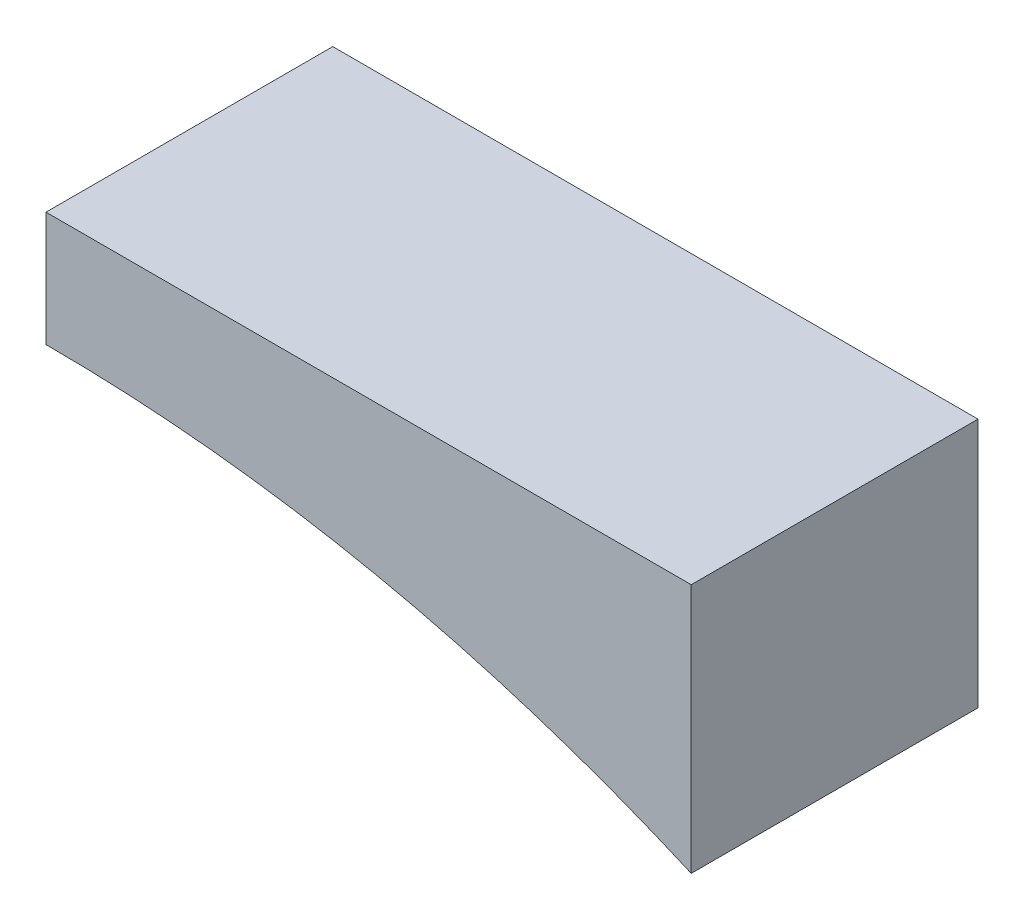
ISO-10303-21;
HEADER;
FILE_DESCRIPTION(('STEP AP214'),'2;1');
FILE_NAME('part.step','',(''),(''),'','','');
FILE_SCHEMA(('AUTOMOTIVE_DESIGN { 1 0 10303 214 1 1 1 1 }'));
ENDSEC;
DATA;
#1=APPLICATION_CONTEXT('core data for automotive mechanical design processes');
#2=APPLICATION_PROTOCOL_DEFINITION('international standard','automotive_design',2000,#1);
#3=PRODUCT_CONTEXT('',#1,'mechanical');
#4=PRODUCT('Part','Part','',(#3));
#5=PRODUCT_RELATED_PRODUCT_CATEGORY('part','',(#4));
#6=PRODUCT_DEFINITION_FORMATION('','',#4);
#7=PRODUCT_DEFINITION_CONTEXT('part definition',#1,'design');
#8=PRODUCT_DEFINITION('design','',#6,#7);
#9=PRODUCT_DEFINITION_SHAPE('','',#8);
#10=(LENGTH_UNIT() NAMED_UNIT(*) SI_UNIT(.MILLI.,.METRE.));
#11=(NAMED_UNIT(*) PLANE_ANGLE_UNIT() SI_UNIT($,.RADIAN.));
#12=(NAMED_UNIT(*) SI_UNIT($,.STERADIAN.) SOLID_ANGLE_UNIT());
#13=UNCERTAINTY_MEASURE_WITH_UNIT(LENGTH_MEASURE(1.E-05),#10,'distance_accuracy_value','');
#14=(GEOMETRIC_REPRESENTATION_CONTEXT(3) GLOBAL_UNCERTAINTY_ASSIGNED_CONTEXT((#13)) GLOBAL_UNIT_ASSIGNED_CONTEXT((#10,
#11,#12)) REPRESENTATION_CONTEXT('',''));
#15=CARTESIAN_POINT('',(0.,0.,0.));
#16=DIRECTION('',(0.,0.,1.));
#17=DIRECTION('',(1.,0.,0.));
#18=AXIS2_PLACEMENT_3D('',#15,#16,#17);
#19=CARTESIAN_POINT('',(0.,0.,20.));
#20=DIRECTION('',(0.,0.,-1.));
#21=DIRECTION('',(-1.,0.,0.));
#22=AXIS2_PLACEMENT_3D('',#19,#20,#21);
#23=CYLINDRICAL_SURFACE('',#22,112.);
#24=CARTESIAN_POINT('',(0.,0.,0.));
#25=DIRECTION('',(0.,0.,-1.));
#26=DIRECTION('',(1.,0.,0.));
#27=AXIS2_PLACEMENT_3D('',#24,#25,#26);
#28=CIRCLE('',#27,112.);
#29=CARTESIAN_POINT('',(0.,112.,0.));
#30=VERTEX_POINT('',#29);
#31=CARTESIAN_POINT('',(45.,102.562176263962,0.));
#32=VERTEX_POINT('',#31);
#33=EDGE_CURVE('E70',#30,#32,#28,.T.);
#34=ORIENTED_EDGE('',*,*,#33,.T.);
#35=DIRECTION('',(0.,0.,-1.));
#36=VECTOR('',#35,1.);
#37=CARTESIAN_POINT('',(45.,102.562176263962,20.));
#38=LINE('',#37,#36);
#39=CARTESIAN_POINT('',(45.,102.562176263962,20.));
#40=VERTEX_POINT('',#39);
#41=EDGE_CURVE('E11',#40,#32,#38,.T.);
#42=ORIENTED_EDGE('',*,*,#41,.F.);
#43=CARTESIAN_POINT('',(0.,0.,20.));
#44=DIRECTION('',(0.,0.,-1.));
#45=DIRECTION('',(1.,0.,0.));
#46=AXIS2_PLACEMENT_3D('',#43,#44,#45);
#47=CIRCLE('',#46,112.);
#48=CARTESIAN_POINT('',(0.,112.,20.));
#49=VERTEX_POINT('',#48);
#50=EDGE_CURVE('E88',#49,#40,#47,.T.);
#51=ORIENTED_EDGE('',*,*,#50,.F.);
#52=DIRECTION('',(0.,0.,-1.));
#53=VECTOR('',#52,1.);
#54=CARTESIAN_POINT('',(0.,112.,20.));
#55=LINE('',#54,#53);
#56=EDGE_CURVE('E82',#49,#30,#55,.T.);
#57=ORIENTED_EDGE('',*,*,#56,.T.);
#58=EDGE_LOOP('',(#34,#42,#51,#57));
#59=FACE_BOUND('',#58,.T.);
#60=ADVANCED_FACE('F26',(#59),#23,.F.);
#61=CARTESIAN_POINT('',(45.,120.,20.));
#62=DIRECTION('',(-1.,0.,0.));
#63=DIRECTION('',(0.,-1.,0.));
#64=AXIS2_PLACEMENT_3D('',#61,#62,#63);
#65=PLANE('',#64);
#66=DIRECTION('',(0.,1.,0.));
#67=VECTOR('',#66,1.);
#68=CARTESIAN_POINT('',(45.,120.,0.));
#69=LINE('',#68,#67);
#70=CARTESIAN_POINT('',(45.,120.,0.));
#71=VERTEX_POINT('',#70);
#72=EDGE_CURVE('E66',#32,#71,#69,.T.);
#73=ORIENTED_EDGE('',*,*,#72,.T.);
#74=DIRECTION('',(0.,0.,-1.));
#75=VECTOR('',#74,1.);
#76=CARTESIAN_POINT('',(45.,120.,20.));
#77=LINE('',#76,#75);
#78=CARTESIAN_POINT('',(45.,120.,20.));
#79=VERTEX_POINT('',#78);
#80=EDGE_CURVE('E33',#79,#71,#77,.T.);
#81=ORIENTED_EDGE('',*,*,#80,.F.);
#82=DIRECTION('',(0.,1.,0.));
#83=VECTOR('',#82,1.);
#84=CARTESIAN_POINT('',(45.,120.,20.));
#85=LINE('',#84,#83);
#86=EDGE_CURVE('E78',#40,#79,#85,.T.);
#87=ORIENTED_EDGE('',*,*,#86,.F.);
#88=ORIENTED_EDGE('',*,*,#41,.T.);
#89=EDGE_LOOP('',(#73,#81,#87,#88));
#90=FACE_BOUND('',#89,.T.);
#91=ADVANCED_FACE('F77',(#90),#65,.F.);
#92=CARTESIAN_POINT('',(0.,120.,20.));
#93=DIRECTION('',(0.,-1.,0.));
#94=DIRECTION('',(1.,0.,0.));
#95=AXIS2_PLACEMENT_3D('',#92,#93,#94);
#96=PLANE('',#95);
#97=DIRECTION('',(-1.,0.,0.));
#98=VECTOR('',#97,1.);
#99=CARTESIAN_POINT('',(0.,120.,0.));
#100=LINE('',#99,#98);
#101=CARTESIAN_POINT('',(0.,120.,0.));
#102=VERTEX_POINT('',#101);
#103=EDGE_CURVE('E71',#71,#102,#100,.T.);
#104=ORIENTED_EDGE('',*,*,#103,.T.);
#105=DIRECTION('',(0.,0.,-1.));
#106=VECTOR('',#105,1.);
#107=CARTESIAN_POINT('',(0.,120.,20.));
#108=LINE('',#107,#106);
#109=CARTESIAN_POINT('',(0.,120.,20.));
#110=VERTEX_POINT('',#109);
#111=EDGE_CURVE('E94',#110,#102,#108,.T.);
#112=ORIENTED_EDGE('',*,*,#111,.F.);
#113=DIRECTION('',(-1.,0.,0.));
#114=VECTOR('',#113,1.);
#115=CARTESIAN_POINT('',(0.,120.,20.));
#116=LINE('',#115,#114);
#117=EDGE_CURVE('E45',#79,#110,#116,.T.);
#118=ORIENTED_EDGE('',*,*,#117,.F.);
#119=ORIENTED_EDGE('',*,*,#80,.T.);
#120=EDGE_LOOP('',(#104,#112,#118,#119));
#121=FACE_BOUND('',#120,.T.);
#122=ADVANCED_FACE('F97',(#121),#96,.F.);
#123=CARTESIAN_POINT('',(0.,112.,20.));
#124=DIRECTION('',(1.,0.,0.));
#125=DIRECTION('',(0.,0.,-1.));
#126=AXIS2_PLACEMENT_3D('',#123,#124,#125);
#127=PLANE('',#126);
#128=DIRECTION('',(0.,-1.,0.));
#129=VECTOR('',#128,1.);
#130=CARTESIAN_POINT('',(0.,112.,0.));
#131=LINE('',#130,#129);
#132=EDGE_CURVE('E86',#102,#30,#131,.T.);
#133=ORIENTED_EDGE('',*,*,#132,.T.);
#134=ORIENTED_EDGE('',*,*,#56,.F.);
#135=DIRECTION('',(0.,-1.,0.));
#136=VECTOR('',#135,1.);
#137=CARTESIAN_POINT('',(0.,112.,20.));
#138=LINE('',#137,#136);
#139=EDGE_CURVE('E40',#110,#49,#138,.T.);
#140=ORIENTED_EDGE('',*,*,#139,.F.);
#141=ORIENTED_EDGE('',*,*,#111,.T.);
#142=EDGE_LOOP('',(#133,#134,#140,#141));
#143=FACE_BOUND('',#142,.T.);
#144=ADVANCED_FACE('F99',(#143),#127,.F.);
#145=CARTESIAN_POINT('',(0.,0.,20.));
#146=DIRECTION('',(0.,0.,1.));
#147=DIRECTION('',(1.,0.,0.));
#148=AXIS2_PLACEMENT_3D('',#145,#146,#147);
#149=PLANE('',#148);
#150=ORIENTED_EDGE('',*,*,#50,.T.);
#151=ORIENTED_EDGE('',*,*,#86,.T.);
#152=ORIENTED_EDGE('',*,*,#117,.T.);
#153=ORIENTED_EDGE('',*,*,#139,.T.);
#154=EDGE_LOOP('',(#150,#151,#152,#153));
#155=FACE_BOUND('',#154,.T.);
#156=ADVANCED_FACE('F100',(#155),#149,.T.);
#157=CARTESIAN_POINT('',(0.,0.,0.));
#158=DIRECTION('',(0.,0.,1.));
#159=DIRECTION('',(1.,0.,0.));
#160=AXIS2_PLACEMENT_3D('',#157,#158,#159);
#161=PLANE('',#160);
#162=ORIENTED_EDGE('',*,*,#33,.F.);
#163=ORIENTED_EDGE('',*,*,#132,.F.);
#164=ORIENTED_EDGE('',*,*,#103,.F.);
#165=ORIENTED_EDGE('',*,*,#72,.F.);
#166=EDGE_LOOP('',(#162,#163,#164,#165));
#167=FACE_BOUND('',#166,.T.);
#168=ADVANCED_FACE('F67',(#167),#161,.F.);
#169=CLOSED_SHELL('',(#60,#91,#122,#144,#156,#168));
#170=MANIFOLD_SOLID_BREP('B2',#169);
#171=ADVANCED_BREP_SHAPE_REPRESENTATION('',(#18,#170),#14);
#172=SHAPE_DEFINITION_REPRESENTATION(#9,#171);
ENDSEC;
END-ISO-10303-21;
